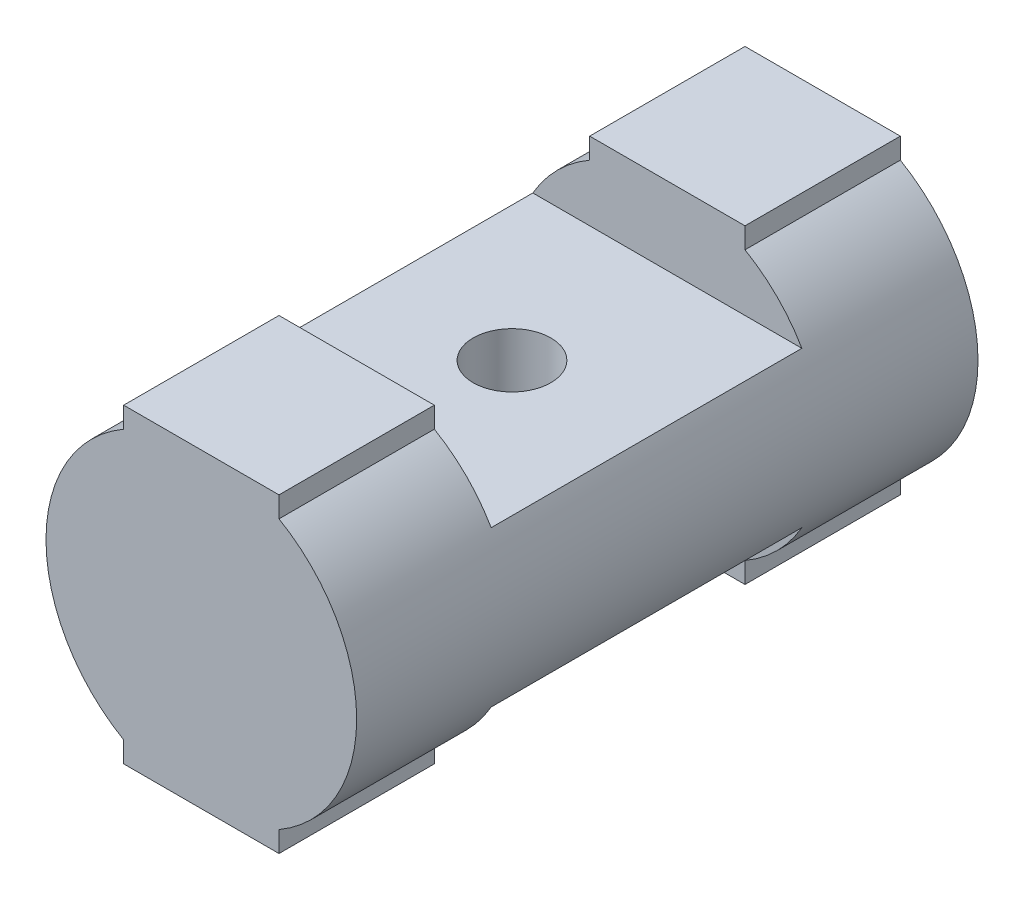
from build123d import *

# Parameters (mm, degrees)
SKETCH1_R           = 10
BOSS_EXTRUDE1_DEPTH = 20
SKETCH2_W           = 10
SKETCH2_H           = 20
BOSS_EXTRUDE2_DEPTH = 40
SKETCH3_W           = 17.320508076
SKETCH3_H           = 5
CUT_EXTRUDE1_DEPTH  = 10
SKETCH4_R           = 2.5
CUT_EXTRUDE2_DEPTH  = 27.925824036


with BuildPart() as part:
    # Sketch1 → Boss-Extrude1 (new, symmetric)
    with BuildSketch(Plane.XY):
        Circle(SKETCH1_R)
    extrude(amount=BOSS_EXTRUDE1_DEPTH, both=True)

    # Sketch2 → Boss-Extrude2 (add)
    with BuildSketch(Plane.XY.offset(20)):
        Rectangle(SKETCH2_W, SKETCH2_H)
    extrude(amount=-BOSS_EXTRUDE2_DEPTH)

    # Sketch3 → Cut-Extrude1 (cut, symmetric)
    with BuildSketch(Plane.XY):
        with Locations((0, 7.5)):
            Rectangle(SKETCH3_W, SKETCH3_H)
    cut_extrude1 = extrude(amount=CUT_EXTRUDE1_DEPTH, both=True, mode=Mode.SUBTRACT)

    # Mirror1: Cut-Extrude1 across plane
    add(cut_extrude1.mirror(Plane.ZX), mode=Mode.SUBTRACT)

    # Sketch4 → Cut-Extrude2 (cut, through all)
    with BuildSketch(Plane(origin=(0, 5, 0), x_dir=(1, 0, 0), z_dir=(0, 1, 0))):
        with Locations(Location((0, 0, 0), (0, 0, 270))):
            Circle(SKETCH4_R)
    extrude(amount=-CUT_EXTRUDE2_DEPTH, mode=Mode.SUBTRACT)


solid = part.part
